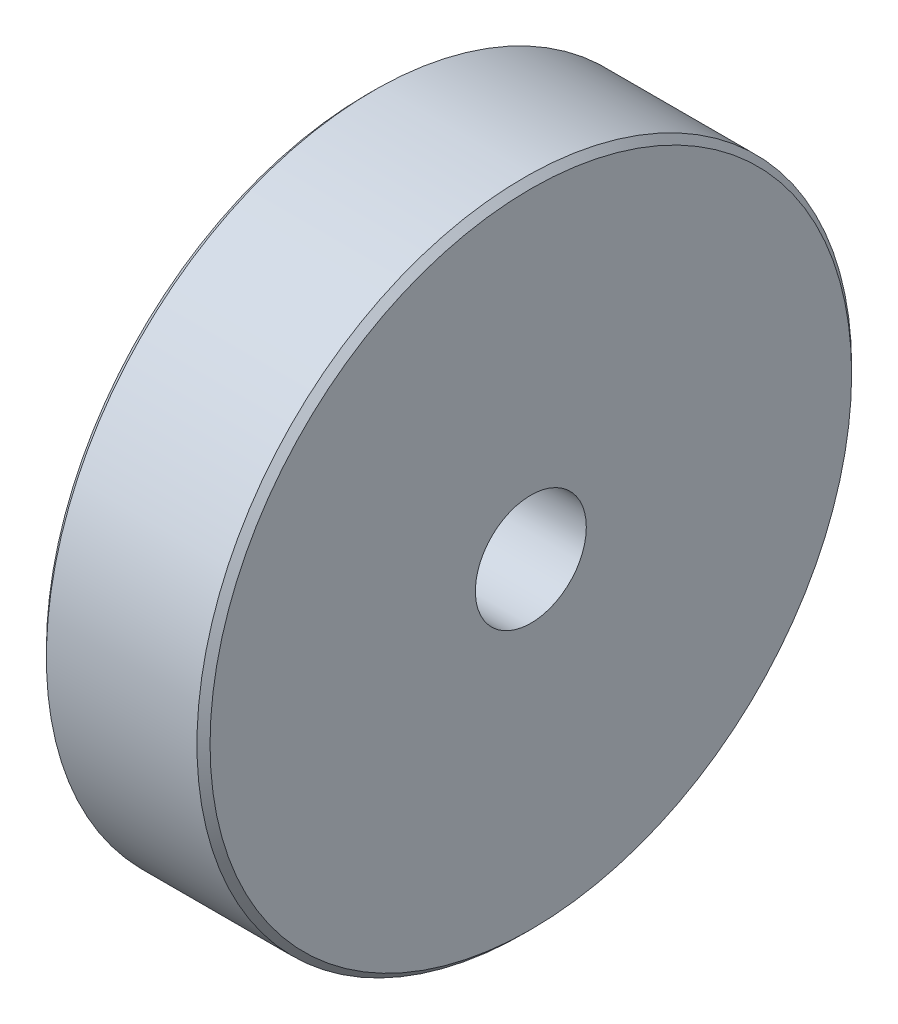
from build123d import *

# Parameters (mm, degrees)
SKETCH1_R                 = 12.7
BOSS_EXTRUDE1_DEPTH       = 6.35
F_8_CLEARANCE_HOLE1_D     = 4.3053
F_8_CLEARANCE_HOLE1_DEPTH = 22.86
F_8_CLEARANCE_HOLE1_TIP   = 1.293442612
CHAMFER1_SIZE             = 0.254


with BuildPart() as part:
    # Sketch1 → Boss-Extrude1 (new body)
    with BuildSketch(Plane(origin=(0, 0, 0), x_dir=(0, 0, -1), z_dir=(1, 0, 0))):
        Circle(SKETCH1_R)
    extrude(amount=BOSS_EXTRUDE1_DEPTH)

    # 8 Clearance Hole1
    with Locations(Plane(origin=(6.35, 0, 0), x_dir=(0, 0, -1), z_dir=(1, 0, 0))):
        with Locations((0, 0)):
            Hole(F_8_CLEARANCE_HOLE1_D / 2, depth=F_8_CLEARANCE_HOLE1_DEPTH)
            with Locations((0, 0, -(F_8_CLEARANCE_HOLE1_DEPTH + F_8_CLEARANCE_HOLE1_TIP / 2))):  # 118° drill point
                Cone(0, F_8_CLEARANCE_HOLE1_D / 2, F_8_CLEARANCE_HOLE1_TIP, mode=Mode.SUBTRACT)

    # Chamfer1
    chamfer1_edges = [part.edges().sort_by_distance(p)[0] for p in [
        (0, 0, 12.7),
        (6.35, 0, 12.7),
    ]]
    chamfer(chamfer1_edges, length=CHAMFER1_SIZE)


solid = part.part
